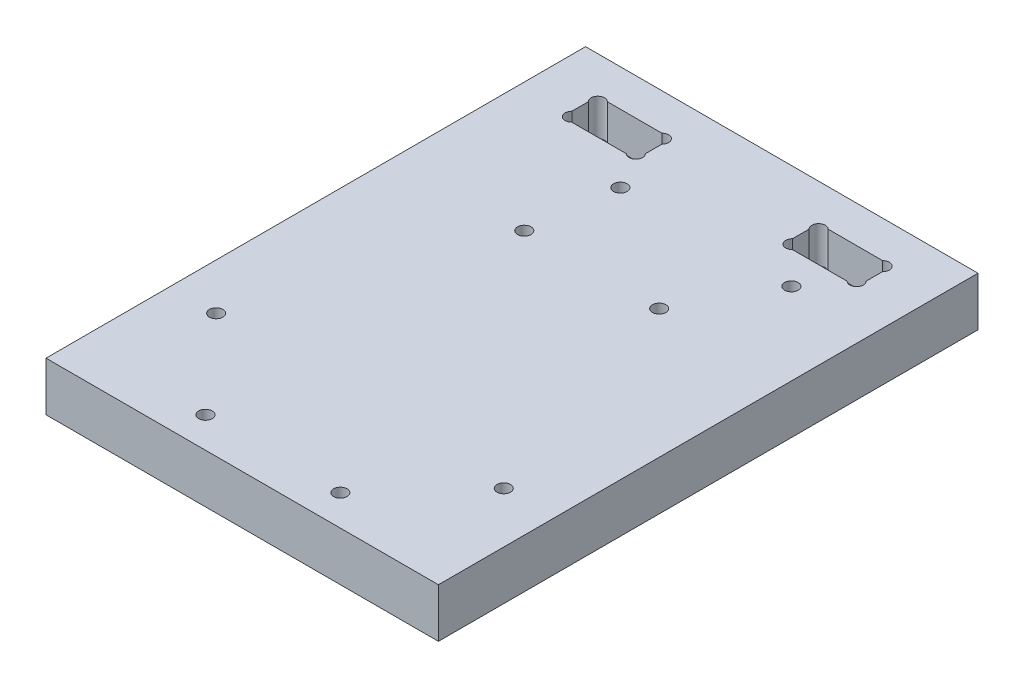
from build123d import *

# Parameters (mm, degrees)
ESQUISSE1_W             = 64
ESQUISSE1_H             = 88
ESQUISSE1_R             = 1.1
BOSS_EXTRU_1_DEPTH      = 8
ESQUISSE2_W             = 18
ESQUISSE2_H             = 11
ENL_V_MAT_EXTRU_1_DEPTH = 2


with BuildPart() as part:
    # Esquisse1 → Boss.-Extru.1 (new body)
    with BuildSketch(Plane(origin=(0, 0, 0), x_dir=(1, 0, 0), z_dir=(0, 1, 0))):
        Rectangle(ESQUISSE1_W, ESQUISSE1_H)
        with Locations(Location((-24.464452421, -23.787230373, 0), (0, 0, 270))):
            Circle(ESQUISSE1_R, mode=Mode.SUBTRACT)
        with Locations(Location((-9.251682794, 26.922517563, 0), (0, 0, 270))):
            Circle(ESQUISSE1_R, mode=Mode.SUBTRACT)
        with Locations(Location((18.63848083, 26.922517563, 0), (0, 0, 270))):
            Circle(ESQUISSE1_R, mode=Mode.SUBTRACT)
        with Locations(Location((23.709575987, -25.055004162, 0), (0, 0, 270))):
            Circle(ESQUISSE1_R, mode=Mode.SUBTRACT)
        with Locations(Location((-11, -39, 0), (0, 0, 270))):
            Circle(ESQUISSE1_R, mode=Mode.SUBTRACT)
        with Locations(Location((11, -39, 0), (0, 0, 90))):
            Circle(ESQUISSE1_R, mode=Mode.SUBTRACT)
        with Locations(Location((11, 13, 0), (0, 0, 270))):
            Circle(ESQUISSE1_R, mode=Mode.SUBTRACT)
        with Locations(Location((-11, 13, 0), (0, 0, 90))):
            Circle(ESQUISSE1_R, mode=Mode.SUBTRACT)
        with BuildLine():
            Line((12, 36.444365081), (12, 33.755634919))
            ThreePointArc((12, 33.755634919), (12, 32.2), (13.555634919, 32.2))
            Line((13.555634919, 32.2), (22.444365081, 32.2))
            ThreePointArc((22.444365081, 32.2), (24, 32.2), (24, 33.755634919))
            Line((24, 33.755634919), (24, 36.444365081))
            ThreePointArc((24, 36.444365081), (24, 38), (22.444365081, 38))
            Line((22.444365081, 38), (13.555634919, 38))
            ThreePointArc((13.555634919, 38), (12, 38), (12, 36.444365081))
        make_face(mode=Mode.SUBTRACT)
        with BuildLine():
            Line((-13.555634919, 38), (-22.444365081, 38))
            ThreePointArc((-22.444365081, 38), (-24, 38), (-24, 36.444365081))
            Line((-24, 36.444365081), (-24, 33.755634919))
            ThreePointArc((-24, 33.755634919), (-24, 32.2), (-22.444365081, 32.2))
            Line((-22.444365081, 32.2), (-13.555634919, 32.2))
            ThreePointArc((-13.555634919, 32.2), (-12, 32.2), (-12, 33.755634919))
            Line((-12, 33.755634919), (-12, 36.444365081))
            ThreePointArc((-12, 36.444365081), (-12, 38), (-13.555634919, 38))
        make_face(mode=Mode.SUBTRACT)
    extrude(amount=BOSS_EXTRU_1_DEPTH)

    # Esquisse2 → Enl_v. mat.-Extru.1 (cut)
    with BuildSketch(Plane.XZ):
        with Locations((-18, -35.1)):
            Rectangle(ESQUISSE2_W, ESQUISSE2_H)
        with Locations((18, -35.1)):
            Rectangle(ESQUISSE2_W, ESQUISSE2_H)
    extrude(amount=-ENL_V_MAT_EXTRU_1_DEPTH, mode=Mode.SUBTRACT)


solid = part.part
